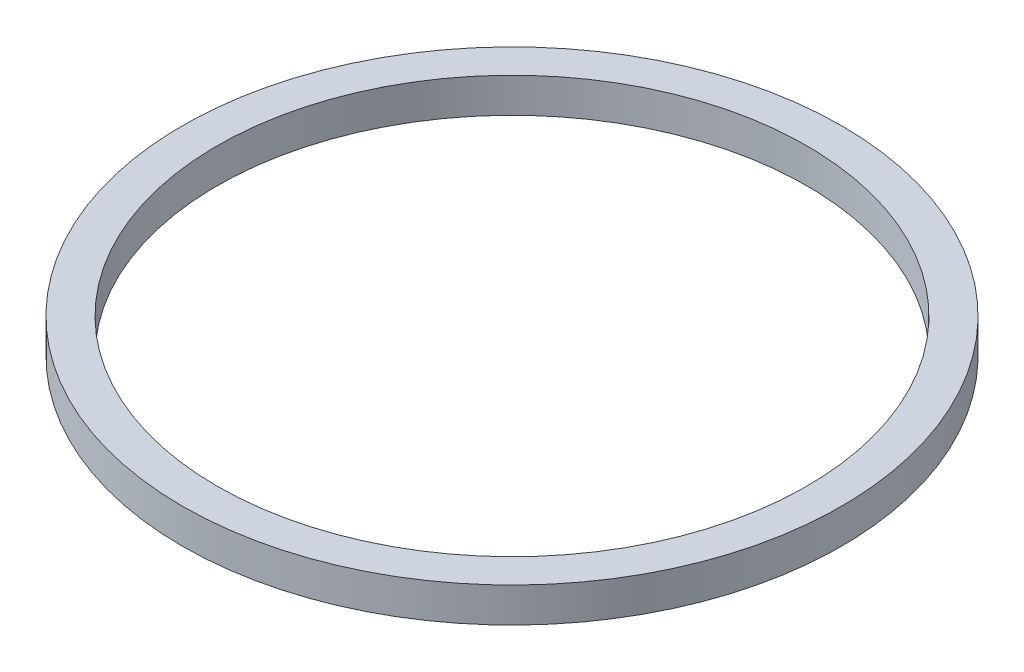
from build123d import *

# Parameters (mm, degrees)
SKETCH1_R      = 60.325
SKETCH1_R_2    = 53.975
EXTRUDE1_DEPTH = 6.35


with BuildPart() as part:
    # Sketch1 → Extrude1 (new body)
    with BuildSketch(Plane(origin=(0, 0, 0), x_dir=(1, 0, 0), z_dir=(0, 1, 0))):
        with Locations(Location((0, 0, 0), (0, 0, 270))):
            Circle(SKETCH1_R)
        with Locations(Location((0, 0, 0), (0, 0, 270))):
            Circle(SKETCH1_R_2, mode=Mode.SUBTRACT)
    extrude(amount=EXTRUDE1_DEPTH)


solid = part.part
